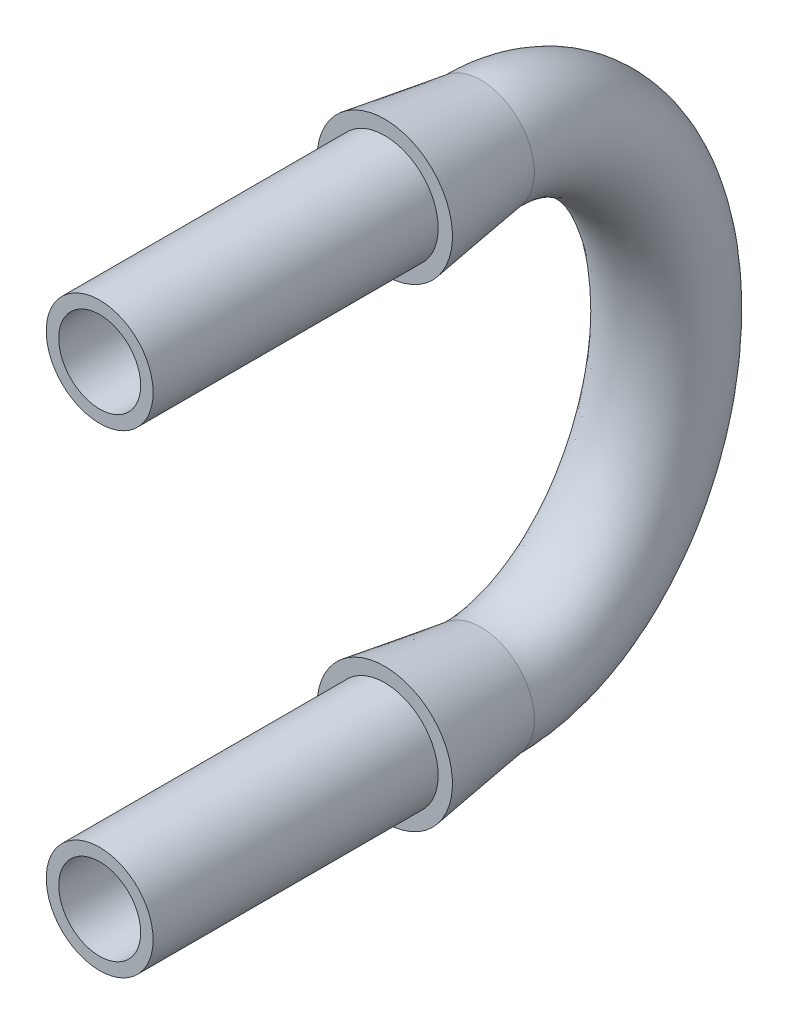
from build123d import *

# Parameters (mm, degrees)
SKETCH1_R           = 7.5
SKETCH1_R_2         = 5.75
BOSS_EXTRUDE3_DEPTH = 43.5
SKETCH7_R           = 7.5
SKETCH7_R_2         = 5.75
BOSS_EXTRUDE4_START = 10
SKETCH10_R          = 7.5
SKETCH10_R_2        = 5.75
BOSS_EXTRUDE4_DEPTH = 10


with BuildPart() as part:
    # Sketch1 → Boss-Extrude3 (new body)
    with BuildSketch(Plane.XY):
        Circle(SKETCH1_R)
        Circle(SKETCH1_R_2, mode=Mode.SUBTRACT)
    extrude(amount=-BOSS_EXTRUDE3_DEPTH)

    # Sketch4 → Revolve1 (revolve)
    with BuildSketch(Plane(origin=(0, 0, 0), x_dir=(0, 0, -1), z_dir=(1, 0, 0)), mode=Mode.PRIVATE) as revolve1_sk:
        Polygon((43.5, 7.5), (30, 7.5), (30, 9.5), align=None)
    revolve(revolve1_sk.sketch.rotate(Axis((0, 0, -43.5), (0, 0, 1)), 270), axis=Axis((0, 0, -43.5), (0, 0, 1)))


with BuildPart() as body_2:
    # Mirror5: mirrored copy
    add(part.part.mirror(Plane(origin=(0, 33.25, 0), x_dir=(0, 0, 1), z_dir=(0, -1, 0))))


with BuildPart() as part_1:
    add(part.part)

    add(body_2.part)  # Sweep13 merges body 2
    # Sweep13: sweep along a path in Sketch8
    with BuildLine() as sweep13_path:  # in the path sketch's own coordinates; laid on its plane below (add() does not lay a ready-made edge on the line's plane)
        add(Edge.make_bspline(
            [(43.5, 0), (69.5, 0), (69.5, 33.25), (69.5, 66.5), (43.5, 66.5)],
            knots=[0, 0, 0, 1.570796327, 1.570796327, 3.141592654, 3.141592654, 3.141592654], degree=2, weights=[1, 0.707106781, 1, 0.707106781, 1]))
    # Sketch7 → Sweep13 (sweep)
    with BuildSketch(Plane(origin=(0, 0, -43.5), x_dir=(-1, 0, 0), z_dir=(0, 0, -1))):
        Circle(SKETCH7_R)
        Circle(SKETCH7_R_2, mode=Mode.SUBTRACT)
    sweep(path=Plane(origin=(0, 0, 0), x_dir=(0, 0, -1), z_dir=(1, 0, 0)) * sweep13_path.line)

    # Sketch10 → Boss-Extrude4 (add)
    # profile 1 of 2: a face of its own
    with BuildSketch(Plane.XY.offset(BOSS_EXTRUDE4_START)):
        Circle(SKETCH10_R)
        Circle(SKETCH10_R_2, mode=Mode.SUBTRACT)
    # profile 2 of 2: a face of its own
    with BuildSketch(Plane.XY.offset(BOSS_EXTRUDE4_START)):
        with Locations((0, 66.5)):
            Circle(SKETCH10_R)
        with Locations((0, 66.5)):
            Circle(SKETCH10_R_2, mode=Mode.SUBTRACT)
    extrude(amount=-BOSS_EXTRUDE4_DEPTH)


solid = part_1.part
